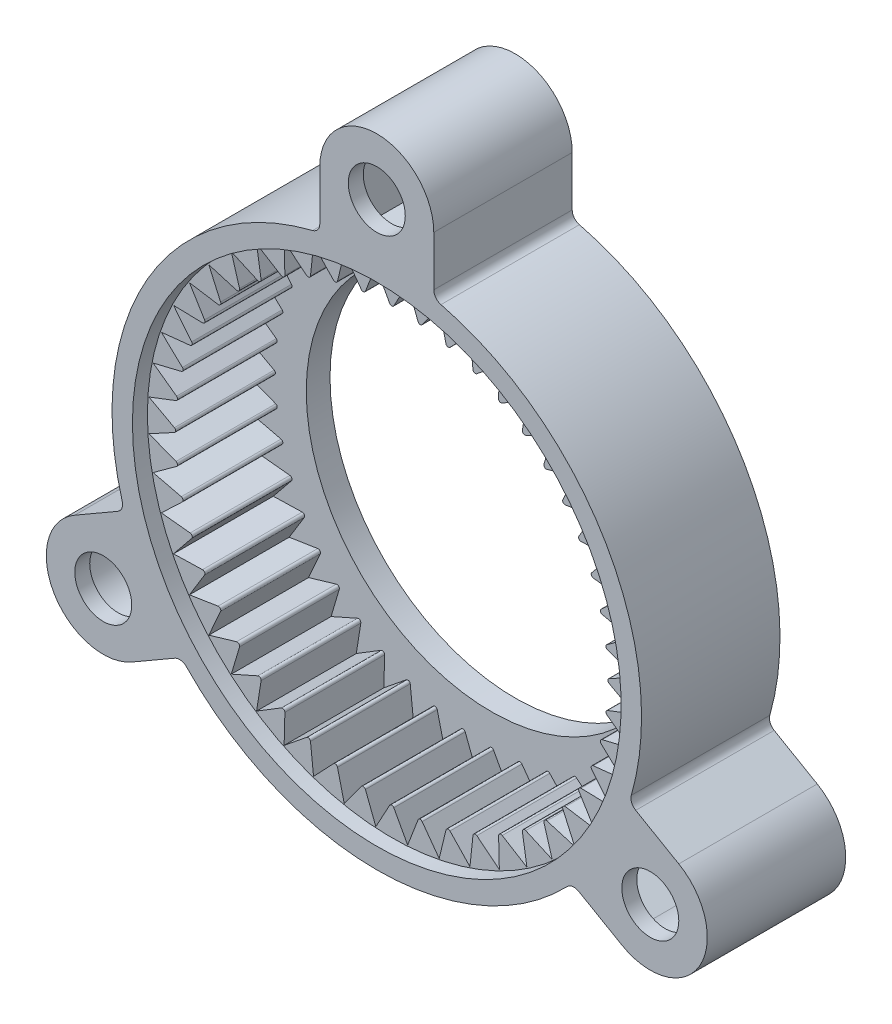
from build123d import *

# Parameters (mm, degrees)
MOUNT_START                       = -7.4041
SKETCH3_R                         = 1.524
MOUNT_DEPTH                       = 7.4041
SHELLING_START                    = -6.604
SHELLING_OF_MOUNT_DEPTH           = 6.604
CIRCULAR_PATTERN_FOR_MOUNTS_COUNT = 3
TOUCH_UP_FILLETS_R                = 0.508
TOOTH_DEPTH                       = 5.334
PATTERN_FOR_TEETH_COUNT           = 48


with BuildPart() as part:
    # Sketch1 → Base revolve (revolve)
    with BuildSketch(Plane(origin=(0, 0, 0), x_dir=(0, 0, -1), z_dir=(1, 0, 0)), mode=Mode.PRIVATE) as base_revolve_sk:
        Polygon((0, 14.1605), (0, 13.0683), (6.1341, 13.0683), (6.1341, 9.906), (7.4041, 9.906), (7.4041, 12.2301), (7.9756, 12.2301), (7.9756, 12.8905), (7.4041, 12.8905), (7.4041, 14.1605), align=None)
    revolve(base_revolve_sk.sketch.rotate(Axis((0, 0, 0), (0, 0, 1)), 90), axis=Axis((0, 0, 0), (0, 0, 1)))

    # Sketch3 → Mount (add)
    with BuildSketch(Plane(origin=(0, 0, -7.4041), x_dir=(-1, 0, 0), z_dir=(0, 0, -1)).offset(MOUNT_START)):
        with BuildLine():
            Line((-3.048, 16.891), (-3.048, 13.828573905))
            ThreePointArc((-3.048, 13.828573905), (0, 14.1605), (3.048, 13.828573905))
            Line((3.048, 13.828573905), (3.048, 16.891))
            ThreePointArc((3.048, 16.891), (0, 19.939), (-3.048, 16.891))
        make_face()
        with Locations((0, 16.891)):
            Circle(SKETCH3_R, mode=Mode.SUBTRACT)
    mount = extrude(amount=MOUNT_DEPTH)

    # Sketch7 → Shelling of mount (cut)
    with BuildSketch(Plane(origin=(0, 0, -7.4041), x_dir=(-1, 0, 0), z_dir=(0, 0, -1)).offset(SHELLING_START)):
        with BuildLine():
            Line((-2.032, 16.891), (-2.032, 14.013947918))
            ThreePointArc((-2.032, 14.013947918), (0, 14.1605), (2.032, 14.013947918))
            Line((2.032, 14.013947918), (2.032, 16.891))
            ThreePointArc((2.032, 16.891), (0, 18.923), (-2.032, 16.891))
        make_face()
    shelling_of_mount = extrude(amount=SHELLING_OF_MOUNT_DEPTH, mode=Mode.SUBTRACT)

    # Circular pattern for mounts: Mount, Shelling of mount ×3 about axis
    circular_pattern_for_mounts_axis = Axis((0, 0, 0), (0, 0, 1))
    add([mount.rotate(circular_pattern_for_mounts_axis, i * 360 / CIRCULAR_PATTERN_FOR_MOUNTS_COUNT) for i in range(1, CIRCULAR_PATTERN_FOR_MOUNTS_COUNT)])
    add([shelling_of_mount.rotate(circular_pattern_for_mounts_axis, i * 360 / CIRCULAR_PATTERN_FOR_MOUNTS_COUNT) for i in range(1, CIRCULAR_PATTERN_FOR_MOUNTS_COUNT)], mode=Mode.SUBTRACT)

    # Touch-up fillets
    touch_up_fillets_edges = [part.edges().sort_by_distance(p)[0] for p in [
        (-3.048, 13.828573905, -3.70205),
        (3.048, 13.828573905, -3.70205),
        (13.4998963, -4.274641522, -3.70205),
        (10.4518963, -9.553932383, -3.70205),
        (-10.4518963, -9.553932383, -3.70205),
        (-13.4998963, -4.274641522, -3.70205),
    ]]
    fillet(touch_up_fillets_edges, radius=TOUCH_UP_FILLETS_R)

    # Sketch8 → Tooth (add)
    with BuildSketch(Plane.XY.offset(-6.1341)):
        with BuildLine():
            Line((-0.111585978, 11.623357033), (-0.9906, 13.240785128))
            Line((-0.9906, 13.240785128), (0.9906, 13.240785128))
            Line((0.9906, 13.240785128), (0.111585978, 11.623357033))
            ThreePointArc((0.111585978, 11.623357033), (0, 11.557), (-0.111585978, 11.623357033))
        make_face()
    tooth = extrude(amount=TOOTH_DEPTH)

    # Pattern for teeth: Tooth ×48 about axis
    pattern_for_teeth_axis = Axis((0, 0, 0), (0, 0, 1))
    for i in range(1, PATTERN_FOR_TEETH_COUNT):
        add(tooth.rotate(pattern_for_teeth_axis, i * 360 / PATTERN_FOR_TEETH_COUNT))


solid = part.part
